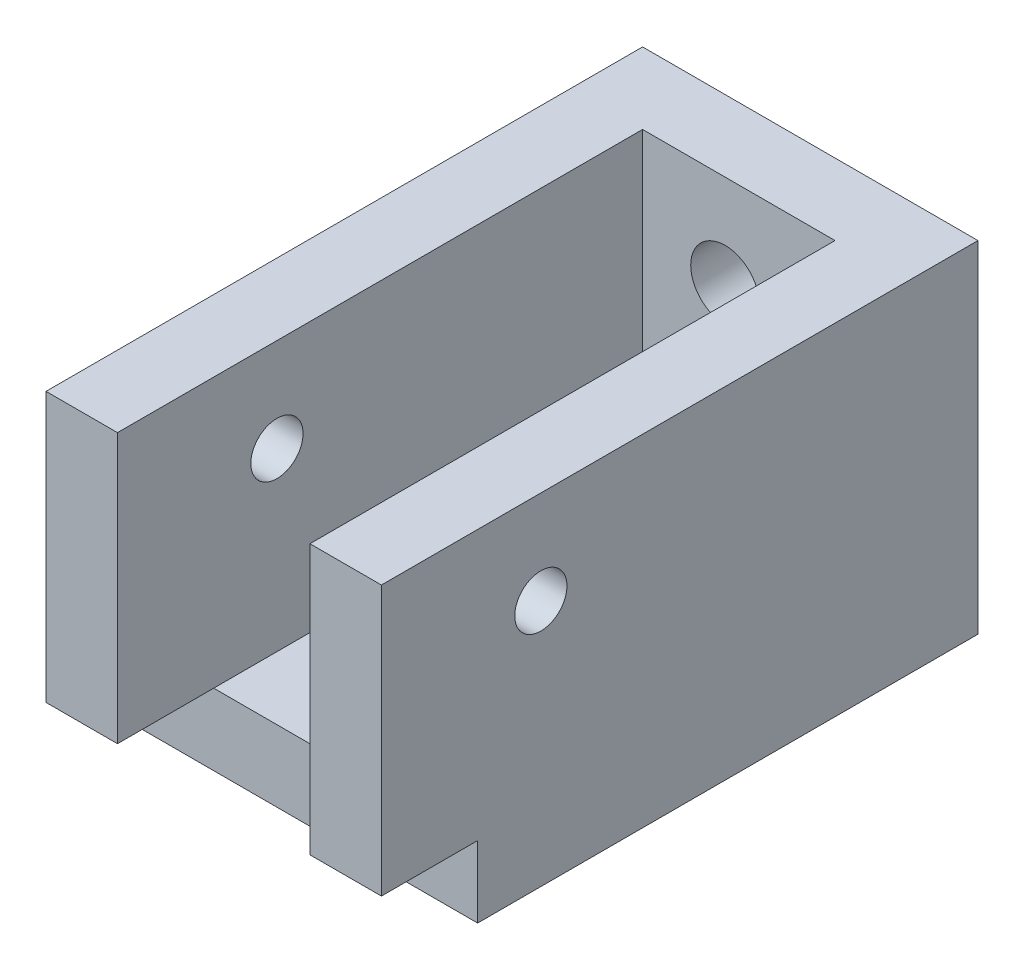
from build123d import *

# Parameters (mm, degrees)
ESQUISSE1_W             = 122
ESQUISSE1_H             = 124
EXTRUSION1_DEPTH        = 26
ESQUISSE2_W             = 26
ESQUISSE2_H             = 98
EXTRUSION2_DEPTH        = 191
ESQUISSE3_W             = 122
ESQUISSE3_H             = 26
EXTRUSION3_DEPTH        = 156
ESQUISSE4_R             = 12.5
ENL_V_MAT_EXTRU_1_DEPTH = 279.116881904
ESQUISSE5_R             = 9.5
ENL_V_MAT_EXTRU_2_DEPTH = 279.116881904


with BuildPart() as part:
    # Esquisse1 → Extrusion1 (new body)
    with BuildSketch(Plane.XY):
        with Locations((61, 62)):
            Rectangle(ESQUISSE1_W, ESQUISSE1_H)
    extrude(amount=EXTRUSION1_DEPTH)

    # Esquisse2 → Extrusion2 (add)
    with BuildSketch(Plane.XY.offset(26)):
        with Locations((13, 75)):
            Rectangle(ESQUISSE2_W, ESQUISSE2_H)
        with Locations((109, 75)):
            Rectangle(ESQUISSE2_W, ESQUISSE2_H)
    extrude(amount=EXTRUSION2_DEPTH)

    # Esquisse3 → Extrusion3 (add)
    with BuildSketch(Plane.XY.offset(26)):
        with Locations((61, 13)):
            Rectangle(ESQUISSE3_W, ESQUISSE3_H)
    extrude(amount=EXTRUSION3_DEPTH)

    # Esquisse4 → Enl_v. mat.-Extru.1 (cut, through all)
    with BuildSketch(Plane(origin=(0, 0, 0), x_dir=(-1, 0, 0), z_dir=(0, 0, -1))):
        with Locations((-56, 90)):
            Circle(ESQUISSE4_R)
    extrude(amount=-ENL_V_MAT_EXTRU_1_DEPTH, mode=Mode.SUBTRACT)

    # Esquisse5 → Enl_v. mat.-Extru.2 (cut, through all)
    with BuildSketch(Plane.ZY):
        with Locations((159, 90)):
            Circle(ESQUISSE5_R)
    extrude(amount=-ENL_V_MAT_EXTRU_2_DEPTH, mode=Mode.SUBTRACT)


solid = part.part
